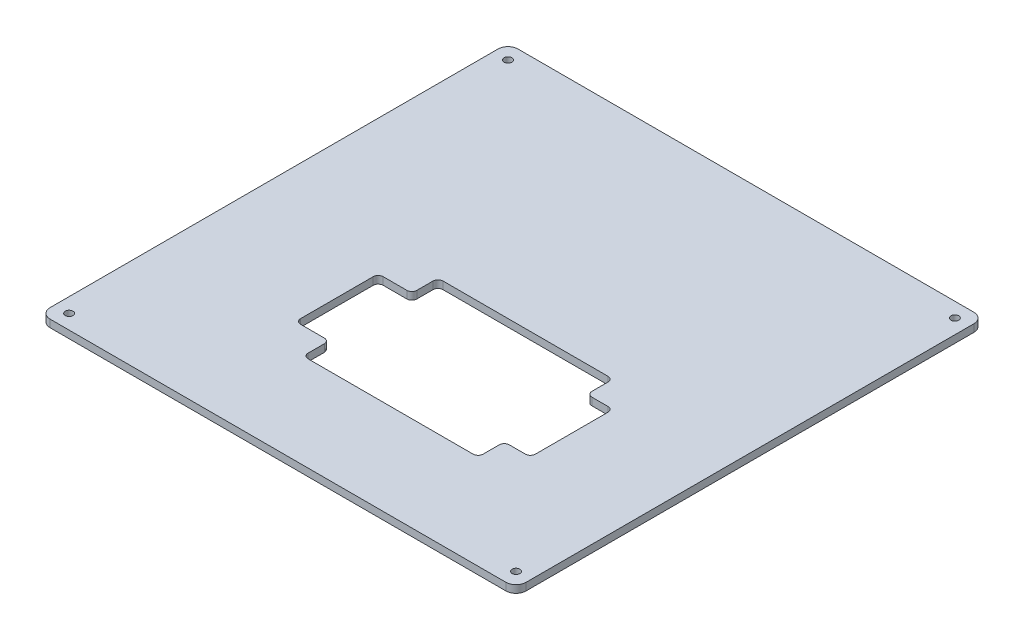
from build123d import *

# Parameters (mm, degrees)
SKETCH1_W           = 190.18
SKETCH1_H           = 186.98
BOSS_EXTRUDE1_DEPTH = 3
CUT_EXTRUDE1_REACH  = 137.214
SKETCH2_W           = 90.83
SKETCH2_H           = 53.9
SKETCH3_W           = 10.45
SKETCH3_H           = 10.45
BOSS_EXTRUDE2_DEPTH = 3
CUT_EXTRUDE2_REACH  = 137.214
SKETCH4_W           = 3
SKETCH4_H           = 33
CUT_EXTRUDE3_REACH  = 137.214
SKETCH5_R           = 1.55
FILLET2_R           = 4
FILLET3_R           = 2


with BuildPart() as part:
    # Sketch1 → Boss-Extrude1 (new body)
    with BuildSketch(Plane(origin=(0, 0, 0), x_dir=(1, 0, 0), z_dir=(0, 1, 0))):
        with Locations((2.55, 0)):
            Rectangle(SKETCH1_W, SKETCH1_H)
    extrude(amount=BOSS_EXTRUDE1_DEPTH)

    # Sketch2 → Cut-Extrude1 (cut, up to next)
    with BuildSketch(Plane.XZ, mode=Mode.PRIVATE) as cut_extrude1_sk1:
        with Locations((9.735, 28.74)):
            Rectangle(SKETCH2_W, SKETCH2_H)
    cut_extrude1_tool1 = extrude(cut_extrude1_sk1.sketch, amount=-CUT_EXTRUDE1_REACH, mode=Mode.PRIVATE) & part.part
    add(cut_extrude1_tool1.solids().sort_by_distance((9.735, 0, 28.74))[0], mode=Mode.SUBTRACT)

    # Sketch3 → Boss-Extrude2 (add)
    with BuildSketch(Plane.XZ):
        with Locations((-30.455, 50.465)):
            Rectangle(SKETCH3_W, SKETCH3_H)
        with Locations((-30.455, 7.015)):
            Rectangle(SKETCH3_W, SKETCH3_H)
        with Locations((49.925, 50.465)):
            Rectangle(SKETCH3_W, SKETCH3_H)
        with Locations((49.925, 7.015)):
            Rectangle(SKETCH3_W, SKETCH3_H)
    extrude(amount=-BOSS_EXTRUDE2_DEPTH)

    # Sketch4 → Cut-Extrude2 (cut, up to next)
    with BuildSketch(Plane.XZ, mode=Mode.PRIVATE) as cut_extrude2_sk1:
        with Locations((-37.18, 28.74)):
            Rectangle(SKETCH4_W, SKETCH4_H)
    cut_extrude2_tool1 = extrude(cut_extrude2_sk1.sketch, amount=-CUT_EXTRUDE2_REACH, mode=Mode.PRIVATE) & part.part
    add(cut_extrude2_tool1.solids().sort_by_distance((-37.18, 0, 28.74))[0], mode=Mode.SUBTRACT)

    # Sketch5 → Cut-Extrude3 (cut, up to next)
    with BuildSketch(Plane.XZ, mode=Mode.PRIVATE) as cut_extrude3_sk1:
        with Locations(Location((-86.74, 87.69, 0), (0, 0, 270))):
            Circle(SKETCH5_R)
    cut_extrude3_tool1 = extrude(cut_extrude3_sk1.sketch, amount=-CUT_EXTRUDE3_REACH, mode=Mode.PRIVATE) & part.part
    # Sketch5 → Cut-Extrude3 (cut, up to next)
    with BuildSketch(Plane.XZ, mode=Mode.PRIVATE) as cut_extrude3_sk2:
        with Locations(Location((91.84, 87.69, 0), (0, 0, 270))):
            Circle(SKETCH5_R)
    cut_extrude3_tool2 = extrude(cut_extrude3_sk2.sketch, amount=-CUT_EXTRUDE3_REACH, mode=Mode.PRIVATE) & part.part
    # Sketch5 → Cut-Extrude3 (cut, up to next)
    with BuildSketch(Plane.XZ, mode=Mode.PRIVATE) as cut_extrude3_sk3:
        with Locations(Location((-86.74, -87.69, 0), (0, 0, 270))):
            Circle(SKETCH5_R)
    cut_extrude3_tool3 = extrude(cut_extrude3_sk3.sketch, amount=-CUT_EXTRUDE3_REACH, mode=Mode.PRIVATE) & part.part
    # Sketch5 → Cut-Extrude3 (cut, up to next)
    with BuildSketch(Plane.XZ, mode=Mode.PRIVATE) as cut_extrude3_sk4:
        with Locations(Location((91.84, -87.69, 0), (0, 0, 270))):
            Circle(SKETCH5_R)
    cut_extrude3_tool4 = extrude(cut_extrude3_sk4.sketch, amount=-CUT_EXTRUDE3_REACH, mode=Mode.PRIVATE) & part.part
    add(cut_extrude3_tool1.solids().sort_by_distance((-86.74, 0, 87.69))[0], mode=Mode.SUBTRACT)
    add(cut_extrude3_tool2.solids().sort_by_distance((91.84, 0, 87.69))[0], mode=Mode.SUBTRACT)
    add(cut_extrude3_tool3.solids().sort_by_distance((-86.74, 0, -87.69))[0], mode=Mode.SUBTRACT)
    add(cut_extrude3_tool4.solids().sort_by_distance((91.84, 0, -87.69))[0], mode=Mode.SUBTRACT)

    # Fillet2
    fillet2_edges = [part.edges().sort_by_distance(p)[0] for p in [
        (-92.54, 1.5, -93.49),
        (97.64, 1.5, -93.49),
        (97.64, 1.5, 93.49),
        (-92.54, 1.5, 93.49),
    ]]
    fillet(fillet2_edges, radius=FILLET2_R)

    # Fillet3
    fillet3_edges = [part.edges().sort_by_distance(p)[0] for p in [
        (-25.23, 1.5, 55.69),
        (-25.23, 1.5, 45.24),
        (-25.23, 1.5, 12.24),
        (-25.23, 1.5, 1.79),
        (55.15, 1.5, 45.24),
        (44.7, 1.5, 45.24),
        (44.7, 1.5, 55.69),
        (55.15, 1.5, 12.24),
        (44.7, 1.5, 1.79),
        (44.7, 1.5, 12.24),
        (-38.68, 1.5, 12.24),
        (-38.68, 1.5, 45.24),
    ]]
    fillet(fillet3_edges, radius=FILLET3_R)


solid = part.part
